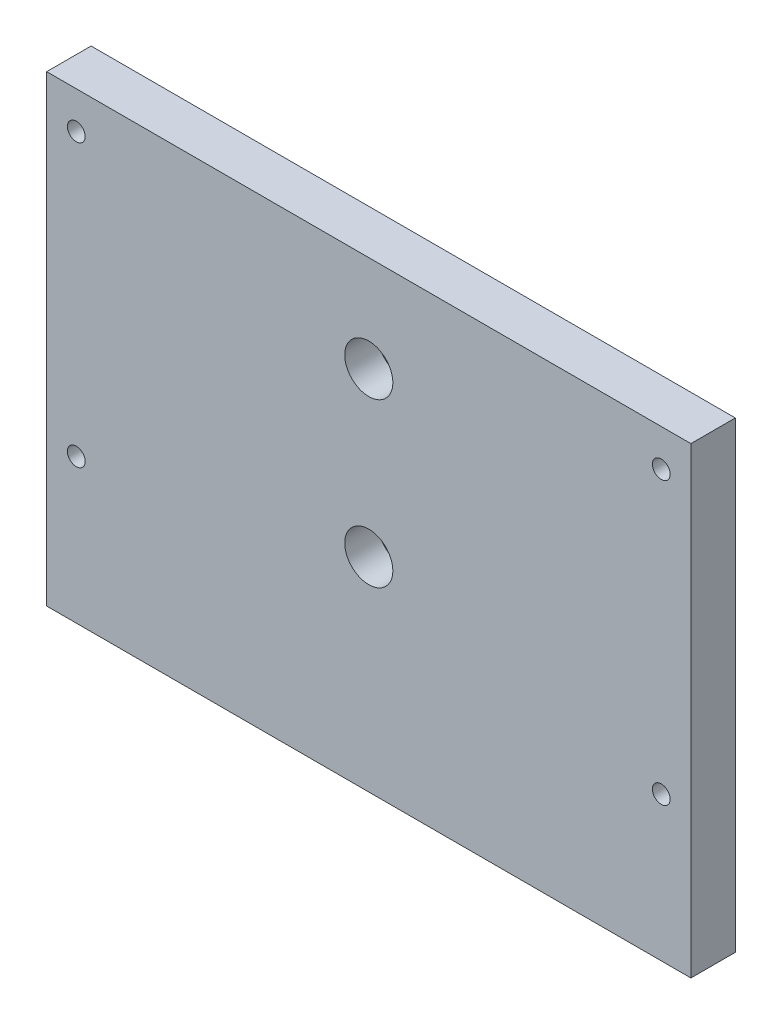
from build123d import *

# Parameters (mm, degrees)
ESQUISSE1_W                                        = 174
ESQUISSE1_H                                        = 125
EXTRUSION1_DEPTH                                   = 12
CHAMBRAGE_POUR_VIS_T_TE_CYLINDRIQUE_FE_D           = 6.6
CHAMBRAGE_POUR_VIS_T_TE_CYLINDRIQUE_FE_CBORE_D     = 13
CHAMBRAGE_POUR_VIS_T_TE_CYLINDRIQUE_FE_CBORE_DEPTH = 9
TROU_TARAUD_M6X1_01_D                              = 4.8
TROU_TARAUD_M6X1_02_D                              = 4.8
TROU_TARAUD_M6X1_02_DEPTH                          = 30
TROU_TARAUD_M6X1_02_TIP                            = 1.442065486


with BuildPart() as part:
    # Esquisse1 → Extrusion1 (new body)
    with BuildSketch(Plane.XY):
        Rectangle(ESQUISSE1_W, ESQUISSE1_H)
    extrude(amount=EXTRUSION1_DEPTH)

    # Chambrage pour vis _ t_te cylindrique fe (through all)
    with Locations(Plane.XY.offset(12)):
        with Locations((0, -7.5), (0, 36.5)):
            CounterBoreHole(CHAMBRAGE_POUR_VIS_T_TE_CYLINDRIQUE_FE_D / 2, CHAMBRAGE_POUR_VIS_T_TE_CYLINDRIQUE_FE_CBORE_D / 2, CHAMBRAGE_POUR_VIS_T_TE_CYLINDRIQUE_FE_CBORE_DEPTH)

    # Trou taraud_ M6x1.01 (through all)
    with Locations(Plane.XY.offset(12)):
        with Locations((-79, -23.5), (-79, 52.5), (79, -23.5), (79, 52.5)):
            Hole(TROU_TARAUD_M6X1_01_D / 2)

    # Trou taraud_ M6x1.02
    with Locations(Plane.ZY.offset(87)):
        with Locations((6, 36.5), (6, -7.5)):
            Hole(TROU_TARAUD_M6X1_02_D / 2, depth=TROU_TARAUD_M6X1_02_DEPTH)
            with Locations((0, 0, -(TROU_TARAUD_M6X1_02_DEPTH + TROU_TARAUD_M6X1_02_TIP / 2))):  # 118° drill point
                Cone(0, TROU_TARAUD_M6X1_02_D / 2, TROU_TARAUD_M6X1_02_TIP, mode=Mode.SUBTRACT)


solid = part.part
